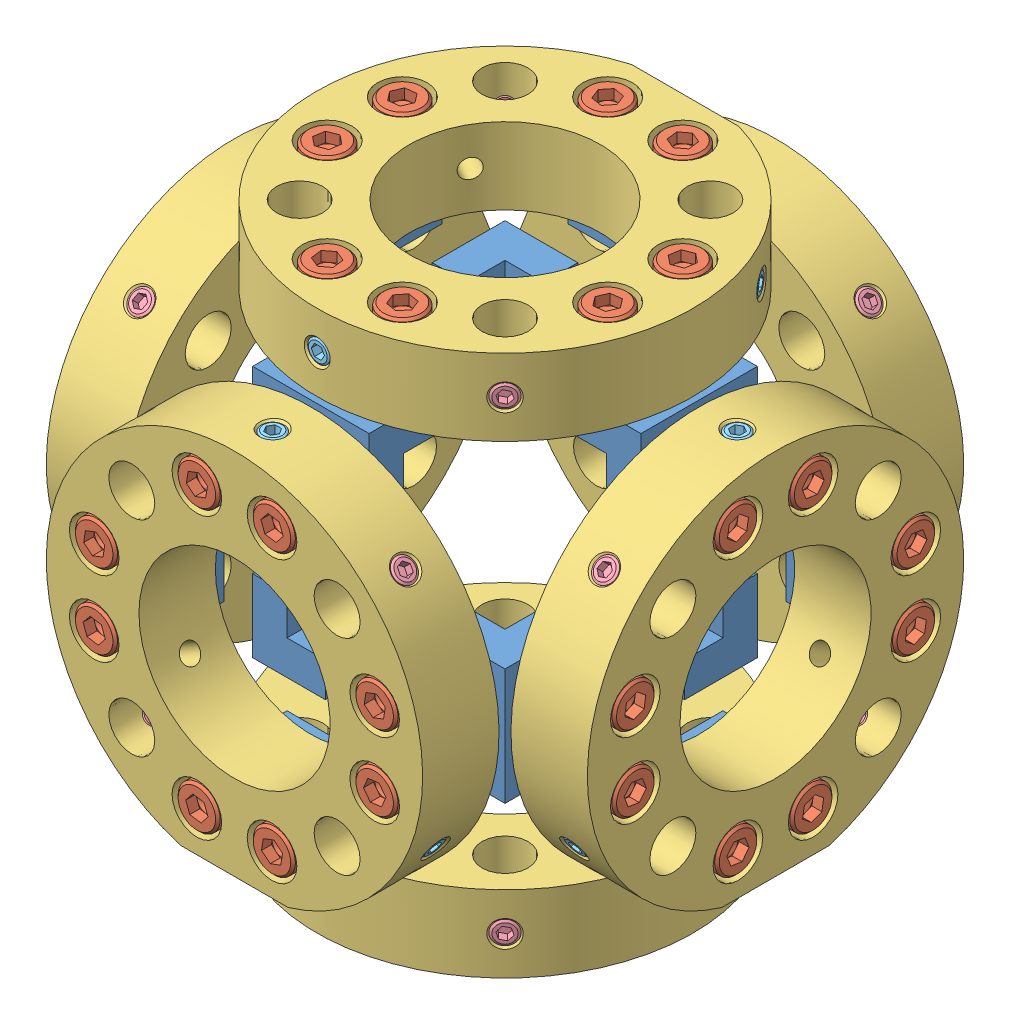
SolidWorks assembly design example 1 working.SLDASM, configuration Default (file format 4700). Lengths in mm.
Overall size (122.39 70.81 123.15).
126 component instances, 5 part files, 60 mates.
Components (placement in the parent):
- 85664-20: 85664.SLDASM [Default] at (26.6136 17.5576 15.4335) x (0 1 0) z (0 0 1) size (17.25 20.92 20.92)
  - 85664-1: 85664.SLDPRT [Default] at (-25.1776 1.211 9.9691) size (15.24 9.53 9.53)
  - M3x10 SHCS included-1: M3x10 SHCS included.SLDPRT [B18.3.1M - 3 x 0.5 x 10 Hex SHCS -- 10NHX] at (-22.4751 8.261 19.9691) x (0 0 -1) z (-0.99205 -0.125844 0) size (13 5.5 5.5)
  - M3x10 SHCS included-6: M3x10 SHCS included.SLDPRT [B18.3.1M - 3 x 0.5 x 10 Hex SHCS -- 10NHX] at (-12.6401 8.261 19.9691) x (0 0 -1) z (-0.778965 0.627068 0) size (13 5.5 5.5)
  - M3x10 SHCS included-5: M3x10 SHCS included.SLDPRT [B18.3.1M - 3 x 0.5 x 10 Hex SHCS -- 10NHX] at (-12.6401 -8.789 2.9191) x (0 1 0) z (-0.778965 0 0.627068) size (13 5.5 5.5)
  - M3x10 SHCS included-4: M3x10 SHCS included.SLDPRT [B18.3.1M - 3 x 0.5 x 10 Hex SHCS -- 10NHX] at (-22.4751 -8.789 2.9191) x (0 1 0) z (-0.35323 0 0.935536) size (13 5.5 5.5)
- 85664-21: 85664.SLDASM [Default] at (26.6136 -17.5576 -15.4335) x (0 -1 0) z (0 0 -1) size (17.25 20.92 20.92)
  - 85664-1: 85664.SLDPRT [Default] at (-25.1776 1.211 9.9691) size (15.24 9.53 9.53)
  - M3x10 SHCS included-1: M3x10 SHCS included.SLDPRT [B18.3.1M - 3 x 0.5 x 10 Hex SHCS -- 10NHX] at (-22.4751 8.261 19.9691) x (0 0 -1) z (-0.99205 -0.125844 0) size (13 5.5 5.5)
  - M3x10 SHCS included-6: M3x10 SHCS included.SLDPRT [B18.3.1M - 3 x 0.5 x 10 Hex SHCS -- 10NHX] at (-12.6401 8.261 19.9691) x (0 0 -1) z (-0.778965 0.627068 0) size (13 5.5 5.5)
  - M3x10 SHCS included-5: M3x10 SHCS included.SLDPRT [B18.3.1M - 3 x 0.5 x 10 Hex SHCS -- 10NHX] at (-12.6401 -8.789 2.9191) x (0 1 0) z (-0.778965 0 0.627068) size (13 5.5 5.5)
  - M3x10 SHCS included-4: M3x10 SHCS included.SLDPRT [B18.3.1M - 3 x 0.5 x 10 Hex SHCS -- 10NHX] at (-22.4751 -8.789 2.9191) x (0 1 0) z (-0.35323 0 0.935536) size (13 5.5 5.5)
- 85632-15: 85632.SLDASM [Default] at (-10.652 1.315 -49.5558) x (0 0 -1) z (1 0 0) size (10 48.22 49.25)
  - 85632 plate-1: 85632 plate.sldprt [Default] at (-24.1532 -1.3149 10.652) size (10 48.23 49.25)
  - M3x2.5 set screw included-1: M3x2.5 set screw included.SLDPRT [B18.3.6M - M3 x 0.5 x 2.5 Hex Socket Flat Pt. SS --N] at (-19.1532 16.045 28.012) x (0 -0.707107 -0.707107) z (0.73062 -0.482801 0.482801) size (2.5 3 3)
  - M3x2.5 set screw included-8: M3x2.5 set screw included.SLDPRT [B18.3.6M - M3 x 0.5 x 2.5 Hex Socket Flat Pt. SS --N] at (-19.1532 16.045 -6.7079) x (0 -0.707107 0.707107) z (0.73062 0.482801 0.482801) size (2.5 3 3)
  - M3x2.5 set screw included-9: M3x2.5 set screw included.SLDPRT [B18.3.6M - M3 x 0.5 x 2.5 Hex Socket Flat Pt. SS --N] at (-19.1532 -18.6749 -6.7079) x (0 0.707107 0.707107) z (0.73062 0.482801 -0.482801) size (2.5 3 3)
  - M3x2.5 set screw included-10: M3x2.5 set screw included.SLDPRT [B18.3.6M - M3 x 0.5 x 2.5 Hex Socket Flat Pt. SS --N] at (-19.1532 -18.6749 28.012) x (0 0.707107 -0.707107) z (0.73062 -0.482801 -0.482801) size (2.5 3 3)
  - M3x6 set screw included-11: M3x6 set screw included.SLDPRT [B18.3.6M - M3 x 0.5 x 6 Hex Socket Flat Pt. SS --N] at (-19.1532 23.1779 10.652) x (0 -1 0) z (0 0 1) size (6 3 3)
  - M3x6 set screw included-12: M3x6 set screw included.SLDPRT [B18.3.6M - M3 x 0.5 x 6 Hex Socket Flat Pt. SS --N] at (-19.1532 -13.5613 -10.5594) x (0 0.5 0.866025) z (0 0.866025 -0.5) size (6 3 3)
  - M3x6 set screw included-13: M3x6 set screw included.SLDPRT [B18.3.6M - M3 x 0.5 x 6 Hex Socket Flat Pt. SS --N] at (-19.1532 -13.5613 31.8634) x (0 0.5 -0.866025) z (0 -0.866025 -0.5) size (6 3 3)
- 85664-23: 85664.SLDASM [Default] at (-26.6136 17.5577 -15.4335) x (0 1 0) z (0 0 -1) size (17.25 20.92 20.92)
  - 85664-1: 85664.SLDPRT [Default] at (-25.1776 1.211 9.9691) size (15.24 9.53 9.53)
  - M3x10 SHCS included-1: M3x10 SHCS included.SLDPRT [B18.3.1M - 3 x 0.5 x 10 Hex SHCS -- 10NHX] at (-22.4751 8.261 19.9691) x (0 0 -1) z (-0.99205 -0.125844 0) size (13 5.5 5.5)
  - M3x10 SHCS included-6: M3x10 SHCS included.SLDPRT [B18.3.1M - 3 x 0.5 x 10 Hex SHCS -- 10NHX] at (-12.6401 8.261 19.9691) x (0 0 -1) z (-0.778965 0.627068 0) size (13 5.5 5.5)
  - M3x10 SHCS included-5: M3x10 SHCS included.SLDPRT [B18.3.1M - 3 x 0.5 x 10 Hex SHCS -- 10NHX] at (-12.6401 -8.789 2.9191) x (0 1 0) z (-0.778965 0 0.627068) size (13 5.5 5.5)
  - M3x10 SHCS included-4: M3x10 SHCS included.SLDPRT [B18.3.1M - 3 x 0.5 x 10 Hex SHCS -- 10NHX] at (-22.4751 -8.789 2.9191) x (0 1 0) z (-0.35323 0 0.935536) size (13 5.5 5.5)
- 85664-24: 85664.SLDASM [Default] at (-15.4335 17.5576 26.6136) x (0 1 0) z (-1 0 0) size (17.25 20.92 20.92)
  - 85664-1: 85664.SLDPRT [Default] at (-25.1776 1.211 9.9691) size (15.24 9.53 9.53)
  - M3x10 SHCS included-1: M3x10 SHCS included.SLDPRT [B18.3.1M - 3 x 0.5 x 10 Hex SHCS -- 10NHX] at (-22.4751 8.261 19.9691) x (0 0 -1) z (-0.99205 -0.125844 0) size (13 5.5 5.5)
  - M3x10 SHCS included-6: M3x10 SHCS included.SLDPRT [B18.3.1M - 3 x 0.5 x 10 Hex SHCS -- 10NHX] at (-12.6401 8.261 19.9691) x (0 0 -1) z (-0.778965 0.627068 0) size (13 5.5 5.5)
  - M3x10 SHCS included-5: M3x10 SHCS included.SLDPRT [B18.3.1M - 3 x 0.5 x 10 Hex SHCS -- 10NHX] at (-12.6401 -8.789 2.9191) x (0 1 0) z (-0.778965 0 0.627068) size (13 5.5 5.5)
  - M3x10 SHCS included-4: M3x10 SHCS included.SLDPRT [B18.3.1M - 3 x 0.5 x 10 Hex SHCS -- 10NHX] at (-22.4751 -8.789 2.9191) x (0 1 0) z (-0.35323 0 0.935536) size (13 5.5 5.5)
- 85632-14: 85632.SLDASM [Default] at (-49.5558 1.3149 10.652) x (-1 0 0) z (0 0 -1) size (10 48.22 49.25)
  - 85632 plate-1: 85632 plate.sldprt [Default] at (-24.1532 -1.3149 10.652) size (10 48.23 49.25)
  - M3x2.5 set screw included-1: M3x2.5 set screw included.SLDPRT [B18.3.6M - M3 x 0.5 x 2.5 Hex Socket Flat Pt. SS --N] at (-19.1532 16.045 28.012) x (0 -0.707107 -0.707107) z (0.73062 -0.482801 0.482801) size (2.5 3 3)
  - M3x2.5 set screw included-8: M3x2.5 set screw included.SLDPRT [B18.3.6M - M3 x 0.5 x 2.5 Hex Socket Flat Pt. SS --N] at (-19.1532 16.045 -6.7079) x (0 -0.707107 0.707107) z (0.73062 0.482801 0.482801) size (2.5 3 3)
  - M3x2.5 set screw included-9: M3x2.5 set screw included.SLDPRT [B18.3.6M - M3 x 0.5 x 2.5 Hex Socket Flat Pt. SS --N] at (-19.1532 -18.6749 -6.7079) x (0 0.707107 0.707107) z (0.73062 0.482801 -0.482801) size (2.5 3 3)
  - M3x2.5 set screw included-10: M3x2.5 set screw included.SLDPRT [B18.3.6M - M3 x 0.5 x 2.5 Hex Socket Flat Pt. SS --N] at (-19.1532 -18.6749 28.012) x (0 0.707107 -0.707107) z (0.73062 -0.482801 -0.482801) size (2.5 3 3)
  - M3x6 set screw included-11: M3x6 set screw included.SLDPRT [B18.3.6M - M3 x 0.5 x 6 Hex Socket Flat Pt. SS --N] at (-19.1532 23.1779 10.652) x (0 -1 0) z (0 0 1) size (6 3 3)
  - M3x6 set screw included-12: M3x6 set screw included.SLDPRT [B18.3.6M - M3 x 0.5 x 6 Hex Socket Flat Pt. SS --N] at (-19.1532 -13.5613 -10.5594) x (0 0.5 0.866025) z (0 0.866025 -0.5) size (6 3 3)
  - M3x6 set screw included-13: M3x6 set screw included.SLDPRT [B18.3.6M - M3 x 0.5 x 6 Hex Socket Flat Pt. SS --N] at (-19.1532 -13.5613 31.8634) x (0 0.5 -0.866025) z (0 -0.866025 -0.5) size (6 3 3)
- 85632-13: 85632.SLDASM [Default] at (10.652 1.3149 49.5558) x (0 0 1) z (-1 0 0) size (10 48.22 49.25)
  - 85632 plate-1: 85632 plate.sldprt [Default] at (-24.1532 -1.3149 10.652) size (10 48.23 49.25)
  - M3x2.5 set screw included-1: M3x2.5 set screw included.SLDPRT [B18.3.6M - M3 x 0.5 x 2.5 Hex Socket Flat Pt. SS --N] at (-19.1532 16.045 28.012) x (0 -0.707107 -0.707107) z (0.73062 -0.482801 0.482801) size (2.5 3 3)
  - M3x2.5 set screw included-8: M3x2.5 set screw included.SLDPRT [B18.3.6M - M3 x 0.5 x 2.5 Hex Socket Flat Pt. SS --N] at (-19.1532 16.045 -6.7079) x (0 -0.707107 0.707107) z (0.73062 0.482801 0.482801) size (2.5 3 3)
  - M3x2.5 set screw included-9: M3x2.5 set screw included.SLDPRT [B18.3.6M - M3 x 0.5 x 2.5 Hex Socket Flat Pt. SS --N] at (-19.1532 -18.6749 -6.7079) x (0 0.707107 0.707107) z (0.73062 0.482801 -0.482801) size (2.5 3 3)
  - M3x2.5 set screw included-10: M3x2.5 set screw included.SLDPRT [B18.3.6M - M3 x 0.5 x 2.5 Hex Socket Flat Pt. SS --N] at (-19.1532 -18.6749 28.012) x (0 0.707107 -0.707107) z (0.73062 -0.482801 -0.482801) size (2.5 3 3)
  - M3x6 set screw included-11: M3x6 set screw included.SLDPRT [B18.3.6M - M3 x 0.5 x 6 Hex Socket Flat Pt. SS --N] at (-19.1532 23.1779 10.652) x (0 -1 0) z (0 0 1) size (6 3 3)
  - M3x6 set screw included-12: M3x6 set screw included.SLDPRT [B18.3.6M - M3 x 0.5 x 6 Hex Socket Flat Pt. SS --N] at (-19.1532 -13.5613 -10.5594) x (0 0.5 0.866025) z (0 0.866025 -0.5) size (6 3 3)
  - M3x6 set screw included-13: M3x6 set screw included.SLDPRT [B18.3.6M - M3 x 0.5 x 6 Hex Socket Flat Pt. SS --N] at (-19.1532 -13.5613 31.8634) x (0 0.5 -0.866025) z (0 -0.866025 -0.5) size (6 3 3)
- 85632-12: 85632.SLDASM [Default] at (49.5558 1.3149 -10.652) size (10 48.22 49.25)
  - 85632 plate-1: 85632 plate.sldprt [Default] at (-24.1532 -1.3149 10.652) size (10 48.23 49.25)
  - M3x2.5 set screw included-1: M3x2.5 set screw included.SLDPRT [B18.3.6M - M3 x 0.5 x 2.5 Hex Socket Flat Pt. SS --N] at (-19.1532 16.045 28.012) x (0 -0.707107 -0.707107) z (0.73062 -0.482801 0.482801) size (2.5 3 3)
  - M3x2.5 set screw included-8: M3x2.5 set screw included.SLDPRT [B18.3.6M - M3 x 0.5 x 2.5 Hex Socket Flat Pt. SS --N] at (-19.1532 16.045 -6.7079) x (0 -0.707107 0.707107) z (0.73062 0.482801 0.482801) size (2.5 3 3)
  - M3x2.5 set screw included-9: M3x2.5 set screw included.SLDPRT [B18.3.6M - M3 x 0.5 x 2.5 Hex Socket Flat Pt. SS --N] at (-19.1532 -18.6749 -6.7079) x (0 0.707107 0.707107) z (0.73062 0.482801 -0.482801) size (2.5 3 3)
  - M3x2.5 set screw included-10: M3x2.5 set screw included.SLDPRT [B18.3.6M - M3 x 0.5 x 2.5 Hex Socket Flat Pt. SS --N] at (-19.1532 -18.6749 28.012) x (0 0.707107 -0.707107) z (0.73062 -0.482801 -0.482801) size (2.5 3 3)
  - M3x6 set screw included-11: M3x6 set screw included.SLDPRT [B18.3.6M - M3 x 0.5 x 6 Hex Socket Flat Pt. SS --N] at (-19.1532 23.1779 10.652) x (0 -1 0) z (0 0 1) size (6 3 3)
  - M3x6 set screw included-12: M3x6 set screw included.SLDPRT [B18.3.6M - M3 x 0.5 x 6 Hex Socket Flat Pt. SS --N] at (-19.1532 -13.5613 -10.5594) x (0 0.5 0.866025) z (0 0.866025 -0.5) size (6 3 3)
  - M3x6 set screw included-13: M3x6 set screw included.SLDPRT [B18.3.6M - M3 x 0.5 x 6 Hex Socket Flat Pt. SS --N] at (-19.1532 -13.5613 31.8634) x (0 0.5 -0.866025) z (0 -0.866025 -0.5) size (6 3 3)
- 85664-25: 85664.SLDASM [Default] at (-26.6136 15.4335 17.5577) x (0 0 1) z (0 1 0) size (17.25 20.92 20.92)
  - 85664-1: 85664.SLDPRT [Default] at (-25.1776 1.211 9.9691) size (15.24 9.53 9.53)
  - M3x10 SHCS included-1: M3x10 SHCS included.SLDPRT [B18.3.1M - 3 x 0.5 x 10 Hex SHCS -- 10NHX] at (-22.4751 8.261 19.9691) x (0 0 -1) z (-0.99205 -0.125844 0) size (13 5.5 5.5)
  - M3x10 SHCS included-6: M3x10 SHCS included.SLDPRT [B18.3.1M - 3 x 0.5 x 10 Hex SHCS -- 10NHX] at (-12.6401 8.261 19.9691) x (0 0 -1) z (-0.778965 0.627068 0) size (13 5.5 5.5)
  - M3x10 SHCS included-5: M3x10 SHCS included.SLDPRT [B18.3.1M - 3 x 0.5 x 10 Hex SHCS -- 10NHX] at (-12.6401 -8.789 2.9191) x (0 1 0) z (-0.778965 0 0.627068) size (13 5.5 5.5)
  - M3x10 SHCS included-4: M3x10 SHCS included.SLDPRT [B18.3.1M - 3 x 0.5 x 10 Hex SHCS -- 10NHX] at (-22.4751 -8.789 2.9191) x (0 1 0) z (-0.35323 0 0.935536) size (13 5.5 5.5)
- 85664-26: 85664.SLDASM [Default] at (-17.5576 15.4336 -26.6136) x (-1 0 0) z (0 1 0) size (17.25 20.92 20.92)
  - 85664-1: 85664.SLDPRT [Default] at (-25.1776 1.211 9.9691) size (15.24 9.53 9.53)
  - M3x10 SHCS included-1: M3x10 SHCS included.SLDPRT [B18.3.1M - 3 x 0.5 x 10 Hex SHCS -- 10NHX] at (-22.4751 8.261 19.9691) x (0 0 -1) z (-0.99205 -0.125844 0) size (13 5.5 5.5)
  - M3x10 SHCS included-6: M3x10 SHCS included.SLDPRT [B18.3.1M - 3 x 0.5 x 10 Hex SHCS -- 10NHX] at (-12.6401 8.261 19.9691) x (0 0 -1) z (-0.778965 0.627068 0) size (13 5.5 5.5)
  - M3x10 SHCS included-5: M3x10 SHCS included.SLDPRT [B18.3.1M - 3 x 0.5 x 10 Hex SHCS -- 10NHX] at (-12.6401 -8.789 2.9191) x (0 1 0) z (-0.778965 0 0.627068) size (13 5.5 5.5)
  - M3x10 SHCS included-4: M3x10 SHCS included.SLDPRT [B18.3.1M - 3 x 0.5 x 10 Hex SHCS -- 10NHX] at (-22.4751 -8.789 2.9191) x (0 1 0) z (-0.35323 0 0.935536) size (13 5.5 5.5)
- 85664-27: 85664.SLDASM [Default] at (26.6136 15.4335 -17.5577) x (0 0 -1) z (0 1 0) size (17.25 20.92 20.92)
  - 85664-1: 85664.SLDPRT [Default] at (-25.1776 1.211 9.9691) size (15.24 9.53 9.53)
  - M3x10 SHCS included-1: M3x10 SHCS included.SLDPRT [B18.3.1M - 3 x 0.5 x 10 Hex SHCS -- 10NHX] at (-22.4751 8.261 19.9691) x (0 0 -1) z (-0.99205 -0.125844 0) size (13 5.5 5.5)
  - M3x10 SHCS included-6: M3x10 SHCS included.SLDPRT [B18.3.1M - 3 x 0.5 x 10 Hex SHCS -- 10NHX] at (-12.6401 8.261 19.9691) x (0 0 -1) z (-0.778965 0.627068 0) size (13 5.5 5.5)
  - M3x10 SHCS included-5: M3x10 SHCS included.SLDPRT [B18.3.1M - 3 x 0.5 x 10 Hex SHCS -- 10NHX] at (-12.6401 -8.789 2.9191) x (0 1 0) z (-0.778965 0 0.627068) size (13 5.5 5.5)
  - M3x10 SHCS included-4: M3x10 SHCS included.SLDPRT [B18.3.1M - 3 x 0.5 x 10 Hex SHCS -- 10NHX] at (-22.4751 -8.789 2.9191) x (0 1 0) z (-0.35323 0 0.935536) size (13 5.5 5.5)
- 85664-28: 85664.SLDASM [Default] at (17.5576 15.4335 26.6136) x (1 0 0) z (0 1 0) size (17.25 20.92 20.92)
  - 85664-1: 85664.SLDPRT [Default] at (-25.1776 1.211 9.9691) size (15.24 9.53 9.53)
  - M3x10 SHCS included-1: M3x10 SHCS included.SLDPRT [B18.3.1M - 3 x 0.5 x 10 Hex SHCS -- 10NHX] at (-22.4751 8.261 19.9691) x (0 0 -1) z (-0.99205 -0.125844 0) size (13 5.5 5.5)
  - M3x10 SHCS included-6: M3x10 SHCS included.SLDPRT [B18.3.1M - 3 x 0.5 x 10 Hex SHCS -- 10NHX] at (-12.6401 8.261 19.9691) x (0 0 -1) z (-0.778965 0.627068 0) size (13 5.5 5.5)
  - M3x10 SHCS included-5: M3x10 SHCS included.SLDPRT [B18.3.1M - 3 x 0.5 x 10 Hex SHCS -- 10NHX] at (-12.6401 -8.789 2.9191) x (0 1 0) z (-0.778965 0 0.627068) size (13 5.5 5.5)
  - M3x10 SHCS included-4: M3x10 SHCS included.SLDPRT [B18.3.1M - 3 x 0.5 x 10 Hex SHCS -- 10NHX] at (-22.4751 -8.789 2.9191) x (0 1 0) z (-0.35323 0 0.935536) size (13 5.5 5.5)
- 85664-29: 85664.SLDASM [Default] at (17.5576 -15.4334 -26.6136) x (1 0 0) z (0 -1 0) size (17.25 20.92 20.92)
  - 85664-1: 85664.SLDPRT [Default] at (-25.1776 1.211 9.9691) size (15.24 9.53 9.53)
  - M3x10 SHCS included-1: M3x10 SHCS included.SLDPRT [B18.3.1M - 3 x 0.5 x 10 Hex SHCS -- 10NHX] at (-22.4751 8.261 19.9691) x (0 0 -1) z (-0.99205 -0.125844 0) size (13 5.5 5.5)
  - M3x10 SHCS included-6: M3x10 SHCS included.SLDPRT [B18.3.1M - 3 x 0.5 x 10 Hex SHCS -- 10NHX] at (-12.6401 8.261 19.9691) x (0 0 -1) z (-0.778965 0.627068 0) size (13 5.5 5.5)
  - M3x10 SHCS included-5: M3x10 SHCS included.SLDPRT [B18.3.1M - 3 x 0.5 x 10 Hex SHCS -- 10NHX] at (-12.6401 -8.789 2.9191) x (0 1 0) z (-0.778965 0 0.627068) size (13 5.5 5.5)
  - M3x10 SHCS included-4: M3x10 SHCS included.SLDPRT [B18.3.1M - 3 x 0.5 x 10 Hex SHCS -- 10NHX] at (-22.4751 -8.789 2.9191) x (0 1 0) z (-0.35323 0 0.935536) size (13 5.5 5.5)
- 85664-30: 85664.SLDASM [Default] at (26.6136 -15.4335 17.5576) x (0 0 1) z (0 -1 0) size (17.25 20.92 20.92)
  - 85664-1: 85664.SLDPRT [Default] at (-25.1776 1.211 9.9691) size (15.24 9.53 9.53)
  - M3x10 SHCS included-1: M3x10 SHCS included.SLDPRT [B18.3.1M - 3 x 0.5 x 10 Hex SHCS -- 10NHX] at (-22.4751 8.261 19.9691) x (0 0 -1) z (-0.99205 -0.125844 0) size (13 5.5 5.5)
  - M3x10 SHCS included-6: M3x10 SHCS included.SLDPRT [B18.3.1M - 3 x 0.5 x 10 Hex SHCS -- 10NHX] at (-12.6401 8.261 19.9691) x (0 0 -1) z (-0.778965 0.627068 0) size (13 5.5 5.5)
  - M3x10 SHCS included-5: M3x10 SHCS included.SLDPRT [B18.3.1M - 3 x 0.5 x 10 Hex SHCS -- 10NHX] at (-12.6401 -8.789 2.9191) x (0 1 0) z (-0.778965 0 0.627068) size (13 5.5 5.5)
  - M3x10 SHCS included-4: M3x10 SHCS included.SLDPRT [B18.3.1M - 3 x 0.5 x 10 Hex SHCS -- 10NHX] at (-22.4751 -8.789 2.9191) x (0 1 0) z (-0.35323 0 0.935536) size (13 5.5 5.5)
- 85664-31: 85664.SLDASM [Default] at (-17.5577 -15.4335 26.6136) x (-1 0 0) z (0 -1 0) size (17.25 20.92 20.92)
  - 85664-1: 85664.SLDPRT [Default] at (-25.1776 1.211 9.9691) size (15.24 9.53 9.53)
  - M3x10 SHCS included-1: M3x10 SHCS included.SLDPRT [B18.3.1M - 3 x 0.5 x 10 Hex SHCS -- 10NHX] at (-22.4751 8.261 19.9691) x (0 0 -1) z (-0.99205 -0.125844 0) size (13 5.5 5.5)
  - M3x10 SHCS included-6: M3x10 SHCS included.SLDPRT [B18.3.1M - 3 x 0.5 x 10 Hex SHCS -- 10NHX] at (-12.6401 8.261 19.9691) x (0 0 -1) z (-0.778965 0.627068 0) size (13 5.5 5.5)
  - M3x10 SHCS included-5: M3x10 SHCS included.SLDPRT [B18.3.1M - 3 x 0.5 x 10 Hex SHCS -- 10NHX] at (-12.6401 -8.789 2.9191) x (0 1 0) z (-0.778965 0 0.627068) size (13 5.5 5.5)
  - M3x10 SHCS included-4: M3x10 SHCS included.SLDPRT [B18.3.1M - 3 x 0.5 x 10 Hex SHCS -- 10NHX] at (-22.4751 -8.789 2.9191) x (0 1 0) z (-0.35323 0 0.935536) size (13 5.5 5.5)
- 85664-32: 85664.SLDASM [Default] at (-26.6136 -15.4335 -17.5576) x (0 0 -1) z (0 -1 0) size (17.25 20.92 20.92)
  - 85664-1: 85664.SLDPRT [Default] at (-25.1776 1.211 9.9691) size (15.24 9.53 9.53)
  - M3x10 SHCS included-1: M3x10 SHCS included.SLDPRT [B18.3.1M - 3 x 0.5 x 10 Hex SHCS -- 10NHX] at (-22.4751 8.261 19.9691) x (0 0 -1) z (-0.99205 -0.125844 0) size (13 5.5 5.5)
  - M3x10 SHCS included-6: M3x10 SHCS included.SLDPRT [B18.3.1M - 3 x 0.5 x 10 Hex SHCS -- 10NHX] at (-12.6401 8.261 19.9691) x (0 0 -1) z (-0.778965 0.627068 0) size (13 5.5 5.5)
  - M3x10 SHCS included-5: M3x10 SHCS included.SLDPRT [B18.3.1M - 3 x 0.5 x 10 Hex SHCS -- 10NHX] at (-12.6401 -8.789 2.9191) x (0 1 0) z (-0.778965 0 0.627068) size (13 5.5 5.5)
  - M3x10 SHCS included-4: M3x10 SHCS included.SLDPRT [B18.3.1M - 3 x 0.5 x 10 Hex SHCS -- 10NHX] at (-22.4751 -8.789 2.9191) x (0 1 0) z (-0.35323 0 0.935536) size (13 5.5 5.5)
- 85632-17: 85632.SLDASM [Default] at (-10.652 49.5558 1.3149) x (0 1 0) z (1 0 0) size (10 48.22 49.25)
  - 85632 plate-1: 85632 plate.sldprt [Default] at (-24.1532 -1.3149 10.652) size (10 48.23 49.25)
  - M3x2.5 set screw included-1: M3x2.5 set screw included.SLDPRT [B18.3.6M - M3 x 0.5 x 2.5 Hex Socket Flat Pt. SS --N] at (-19.1532 16.045 28.012) x (0 -0.707107 -0.707107) z (0.73062 -0.482801 0.482801) size (2.5 3 3)
  - M3x2.5 set screw included-8: M3x2.5 set screw included.SLDPRT [B18.3.6M - M3 x 0.5 x 2.5 Hex Socket Flat Pt. SS --N] at (-19.1532 16.045 -6.7079) x (0 -0.707107 0.707107) z (0.73062 0.482801 0.482801) size (2.5 3 3)
  - M3x2.5 set screw included-9: M3x2.5 set screw included.SLDPRT [B18.3.6M - M3 x 0.5 x 2.5 Hex Socket Flat Pt. SS --N] at (-19.1532 -18.6749 -6.7079) x (0 0.707107 0.707107) z (0.73062 0.482801 -0.482801) size (2.5 3 3)
  - M3x2.5 set screw included-10: M3x2.5 set screw included.SLDPRT [B18.3.6M - M3 x 0.5 x 2.5 Hex Socket Flat Pt. SS --N] at (-19.1532 -18.6749 28.012) x (0 0.707107 -0.707107) z (0.73062 -0.482801 -0.482801) size (2.5 3 3)
  - M3x6 set screw included-11: M3x6 set screw included.SLDPRT [B18.3.6M - M3 x 0.5 x 6 Hex Socket Flat Pt. SS --N] at (-19.1532 23.1779 10.652) x (0 -1 0) z (0 0 1) size (6 3 3)
  - M3x6 set screw included-12: M3x6 set screw included.SLDPRT [B18.3.6M - M3 x 0.5 x 6 Hex Socket Flat Pt. SS --N] at (-19.1532 -13.5613 -10.5594) x (0 0.5 0.866025) z (0 0.866025 -0.5) size (6 3 3)
  - M3x6 set screw included-13: M3x6 set screw included.SLDPRT [B18.3.6M - M3 x 0.5 x 6 Hex Socket Flat Pt. SS --N] at (-19.1532 -13.5613 31.8634) x (0 0.5 -0.866025) z (0 -0.866025 -0.5) size (6 3 3)
- 85632-16: 85632.SLDASM [Default] at (10.652 -49.5558 1.3149) x (0 -1 0) z (-1 0 0) size (10 48.22 49.25)
  - 85632 plate-1: 85632 plate.sldprt [Default] at (-24.1532 -1.3149 10.652) size (10 48.23 49.25)
  - M3x2.5 set screw included-1: M3x2.5 set screw included.SLDPRT [B18.3.6M - M3 x 0.5 x 2.5 Hex Socket Flat Pt. SS --N] at (-19.1532 16.045 28.012) x (0 -0.707107 -0.707107) z (0.73062 -0.482801 0.482801) size (2.5 3 3)
  - M3x2.5 set screw included-8: M3x2.5 set screw included.SLDPRT [B18.3.6M - M3 x 0.5 x 2.5 Hex Socket Flat Pt. SS --N] at (-19.1532 16.045 -6.7079) x (0 -0.707107 0.707107) z (0.73062 0.482801 0.482801) size (2.5 3 3)
  - M3x2.5 set screw included-9: M3x2.5 set screw included.SLDPRT [B18.3.6M - M3 x 0.5 x 2.5 Hex Socket Flat Pt. SS --N] at (-19.1532 -18.6749 -6.7079) x (0 0.707107 0.707107) z (0.73062 0.482801 -0.482801) size (2.5 3 3)
  - M3x2.5 set screw included-10: M3x2.5 set screw included.SLDPRT [B18.3.6M - M3 x 0.5 x 2.5 Hex Socket Flat Pt. SS --N] at (-19.1532 -18.6749 28.012) x (0 0.707107 -0.707107) z (0.73062 -0.482801 -0.482801) size (2.5 3 3)
  - M3x6 set screw included-11: M3x6 set screw included.SLDPRT [B18.3.6M - M3 x 0.5 x 6 Hex Socket Flat Pt. SS --N] at (-19.1532 23.1779 10.652) x (0 -1 0) z (0 0 1) size (6 3 3)
  - M3x6 set screw included-12: M3x6 set screw included.SLDPRT [B18.3.6M - M3 x 0.5 x 6 Hex Socket Flat Pt. SS --N] at (-19.1532 -13.5613 -10.5594) x (0 0.5 0.866025) z (0 0.866025 -0.5) size (6 3 3)
  - M3x6 set screw included-13: M3x6 set screw included.SLDPRT [B18.3.6M - M3 x 0.5 x 6 Hex Socket Flat Pt. SS --N] at (-19.1532 -13.5613 31.8634) x (0 0.5 -0.866025) z (0 -0.866025 -0.5) size (6 3 3)
Mates (geometry in assembly coordinates):
- Concentric27: concentric anti-aligned: cone of 85664-21/85664-1 through (18.3526 4.9176 -25.1026) axis (0 0 1); cylinder of 85632-15/85632 plate-1 through (18.3526 4.9177 -35.4026) axis (0 0 -1) radius 1.6
- Coincident21: coincident anti-aligned: plane of 85664-21/85664-1 through (20.6401 -7.6199 -25.4026) normal (0 0 -1); plane of 85632-15/85632 plate-1 through (0 0.0001 -25.4026) normal (0 0 1)
- Concentric32: concentric anti-aligned: cylinder of 85632-15/85632 plate-1 through (-18.3526 4.9177 -35.4026) axis (0 0 -1) radius 1.6; cone of 85664-23/85664-1 through (-18.3526 4.9176 -25.1026) axis (0 0 1)
- Coincident23: coincident anti-aligned: plane of 85632-15/85632 plate-1 through (0 0.0001 -25.4026) normal (0 0 1); plane of 85664-23/85664-1 through (-20.6401 7.6201 -25.4026) normal (0 0 -1)
- Concentric37: concentric anti-aligned: cone of 85664-24/85664-1 through (-25.1026 4.9174 18.3526) axis (1 0 0); cylinder of 85632-14/85632 plate-1 through (-35.4026 4.9176 18.3526) axis (-1 0 0) radius 1.6
- Coincident25: coincident anti-aligned: plane of 85664-24/85664-1 through (-25.4026 7.6199 20.6401) normal (-1 0 0); plane of 85632-14/85632 plate-1 through (-25.4026 0 0) normal (1 0 0)
- Concentric43: concentric anti-aligned: cone of 85664-24/85664-1 through (-18.3526 4.9174 25.1026) axis (0 0 -1); cylinder of 85632-13/85632 plate-1 through (-18.3526 4.9176 35.4026) axis (0 0 1) radius 1.6
- Coincident29: coincident anti-aligned: plane of 85664-24/85664-1 through (-10.0212 7.6199 25.4026) normal (0 0 1); plane of 85632-13/85632 plate-1 through (0 0 25.4026) normal (0 0 -1)
- Concentric49: concentric anti-aligned: cone of 85664-21/85664-1 through (25.1026 -4.9174 -18.3526) axis (-1 0 0); cylinder of 85632-12/85632 plate-1 through (35.4026 -4.9176 -18.3526) axis (1 0 0) radius 1.6
- Coincident35: coincident anti-aligned: plane of 85664-21/85664-1 through (25.4026 -7.6199 -10.0212) normal (1 0 0); plane of 85632-12/85632 plate-1 through (25.4026 0 0) normal (-1 0 0)
- Concentric52: concentric anti-aligned: cylinder of 85632-14/85632 plate-1 through (-35.4026 18.3526 -4.9176) axis (-1 0 0) radius 1.6; cone of 85664-25/85664-1 through (-25.1026 18.3526 -4.9174) axis (1 0 0)
- Coincident37: coincident anti-aligned: plane of 85632-14/85632 plate-1 through (-25.4026 0 0) normal (1 0 0); plane of 85664-25/85664-1 through (-25.4026 10.0212 7.6201) normal (-1 0 0)
- Concentric54: concentric anti-aligned: cylinder of 85632-15/85632 plate-1 through (-4.9176 18.3527 -35.4026) axis (0 0 -1) radius 1.6; cone of 85664-26/85664-1 through (-4.9174 18.3527 -25.1026) axis (0 0 1)
- Coincident38: coincident anti-aligned: plane of 85632-15/85632 plate-1 through (0 0.0001 -25.4026) normal (0 0 1); plane of 85664-26/85664-1 through (-7.6199 10.0213 -25.4026) normal (0 0 -1)
- Concentric56: concentric anti-aligned: cylinder of 85632-12/85632 plate-1 through (35.4026 18.3526 4.9176) axis (1 0 0) radius 1.6; cone of 85664-27/85664-1 through (25.1026 18.3526 4.9174) axis (-1 0 0)
- Coincident39: coincident anti-aligned: plane of 85632-12/85632 plate-1 through (25.4026 0 0) normal (-1 0 0); plane of 85664-27/85664-1 through (25.4026 10.0212 -7.6201) normal (1 0 0)
- Concentric58: concentric anti-aligned: cylinder of 85632-13/85632 plate-1 through (4.9176 18.3526 35.4026) axis (0 0 1) radius 1.6; cone of 85664-28/85664-1 through (4.9174 18.3526 25.1026) axis (0 0 -1)
- Coincident40: coincident anti-aligned: plane of 85632-13/85632 plate-1 through (0 0 25.4026) normal (0 0 -1); plane of 85664-28/85664-1 through (7.6199 10.0212 25.4026) normal (0 0 1)
- Concentric61: concentric anti-aligned: cylinder of 85632-15/85632 plate-1 through (4.9176 -18.3525 -35.4026) axis (0 0 -1) radius 1.6; cone of 85664-29/85664-1 through (4.9174 -18.3525 -25.1026) axis (0 0 1)
- Coincident42: coincident anti-aligned: plane of 85632-15/85632 plate-1 through (0 0.0001 -25.4026) normal (0 0 1); plane of 85664-29/85664-1 through (7.6199 -10.021 -25.4026) normal (0 0 -1)
- Concentric63: concentric anti-aligned: cylinder of 85632-13/85632 plate-1 through (4.9176 -18.3526 35.4026) axis (0 0 1) radius 1.6; cone of 85664-31/85664-1 through (4.9174 -18.3526 25.1026) axis (0 0 -1)
- Coincident43: coincident anti-aligned: plane of 85632-13/85632 plate-1 through (0 0 25.4026) normal (0 0 -1); plane of 85664-31/85664-1 through (-7.6201 -10.0212 25.4026) normal (0 0 1)
- Concentric65: concentric anti-aligned: cylinder of 85632-12/85632 plate-1 through (35.4026 -18.3526 4.9176) axis (1 0 0) radius 1.6; cone of 85664-30/85664-1 through (25.1026 -18.3526 4.9174) axis (-1 0 0)
- Coincident44: coincident anti-aligned: plane of 85632-12/85632 plate-1 through (25.4026 0 0) normal (-1 0 0); plane of 85664-30/85664-1 through (25.4026 -10.0212 7.6199) normal (1 0 0)
- Concentric67: concentric anti-aligned: cylinder of 85632-14/85632 plate-1 through (-35.4026 -18.3526 -4.9176) axis (-1 0 0) radius 1.6; cone of 85664-32/85664-1 through (-25.1026 -18.3526 -4.9174) axis (1 0 0)
- Coincident45: coincident anti-aligned: plane of 85632-14/85632 plate-1 through (-25.4026 0 0) normal (1 0 0); plane of 85664-32/85664-1 through (-25.4026 -10.0212 -7.6199) normal (-1 0 0)
- Coincident46: coincident anti-aligned: plane of 85664-26/85664-1 through (-7.6199 25.4027 -20.6401) normal (0 1 0); plane of 85632-17/85632 plate-1 through (0 25.4026 0) normal (0 -1 0)
- Coincident47: coincident anti-aligned: plane of 85664-32/85664-1 through (-20.6401 -25.4026 -7.6199) normal (0 -1 0); plane of 85632-16/85632 plate-1 through (0 -25.4026 0) normal (0 1 0)
- Concentric78: concentric aligned: cylinder of 85632-12/85632 plate-1 through (35.4026 0 0) axis (-1 0 0) radius 24.625
- Concentric79: concentric anti-aligned: cylinder of 85632-13/85632 plate-1 through (0 0 35.4026) axis (0 0 -1) radius 24.625
- Concentric81: concentric aligned: cylinder of 85632-12/85632 plate-1 through (35.4026 18.3526 -4.9176) axis (1 0 0) radius 1.6; cylinder of 85664-27/85664-1 through (25.4026 18.3526 -4.9176) axis (1 0 0) radius 1.25
- Concentric82: concentric aligned: cylinder of 85632-12/85632 plate-1 through (35.4026 -18.3526 -4.9176) axis (1 0 0) radius 1.6; cylinder of 85664-30/85664-1 through (25.4026 -18.3526 -4.9176) axis (1 0 0) radius 1.25
- Concentric83: concentric aligned: cylinder of 85632-15/85632 plate-1 through (-4.9176 -18.3525 -35.4026) axis (0 0 -1) radius 1.6; cylinder of 85664-29/85664-1 through (-4.9176 -18.3525 -25.4026) axis (0 0 -1) radius 1.25
- Concentric84: concentric aligned: cylinder of 85632-15/85632 plate-1 through (-18.3526 -4.9174 -35.4026) axis (0 0 -1) radius 1.6; cylinder of 85664-23/85664-1 through (-18.3526 -4.9174 -25.4026) axis (0 0 -1) radius 1.25
- Concentric85: concentric aligned: cylinder of 85632-15/85632 plate-1 through (4.9176 18.3527 -35.4026) axis (0 0 -1) radius 1.6; cylinder of 85664-26/85664-1 through (4.9176 18.3527 -25.4026) axis (0 0 -1) radius 1.25
- Concentric86: concentric aligned: cylinder of 85664-21/85664-1 through (18.3526 -4.9174 -25.4026) axis (0 0 -1) radius 1.25; cylinder of 85632-15/85632 plate-1 through (18.3526 -4.9174 -35.4026) axis (0 0 -1) radius 1.6
- Concentric87: concentric aligned: cylinder of 85664-21/85664-1 through (25.4026 4.9176 -18.3526) axis (1 0 0) radius 1.25; cylinder of 85632-12/85632 plate-1 through (35.4026 4.9176 -18.3526) axis (1 0 0) radius 1.6
- Concentric88: concentric aligned: cylinder of 85632-13/85632 plate-1 through (-4.9176 18.3526 35.4026) axis (0 0 1) radius 1.6; cylinder of 85664-28/85664-1 through (-4.9176 18.3526 25.4026) axis (0 0 1) radius 1.25
- Concentric89: concentric aligned: cylinder of 85664-24/85664-1 through (-18.3526 -4.9176 25.4026) axis (0 0 1) radius 1.25; cylinder of 85632-13/85632 plate-1 through (-18.3526 -4.9176 35.4026) axis (0 0 1) radius 1.6
- Concentric90: concentric aligned: cylinder of 85664-24/85664-1 through (-25.4026 -4.9176 18.3526) axis (-1 0 0) radius 1.25; cylinder of 85632-14/85632 plate-1 through (-35.4026 -4.9176 18.3526) axis (-1 0 0) radius 1.6
- Concentric91: concentric aligned: cylinder of 85632-13/85632 plate-1 through (-4.9176 -18.3526 35.4026) axis (0 0 1) radius 1.6; cylinder of 85664-31/85664-1 through (-4.9176 -18.3526 25.4026) axis (0 0 1) radius 1.25
- Concentric93: concentric aligned: cylinder of 85632-14/85632 plate-1 through (-35.4026 -18.3526 4.9176) axis (-1 0 0) radius 1.6; cylinder of 85664-32/85664-1 through (-25.4026 -18.3526 4.9176) axis (-1 0 0) radius 1.25
- Coincident51: coincident anti-aligned: plane of 85664-20/85664-1 through (20.6401 7.6199 25.4026) normal (0 0 1); plane of 85632-13/85632 plate-1 through (0 0 25.4026) normal (0 0 -1)
- Concentric96: concentric aligned: cylinder of 85664-20/85664-1 through (18.3526 4.9174 25.4026) axis (0 0 1) radius 1.25; cylinder of 85632-13/85632 plate-1 through (18.3526 4.9176 35.4026) axis (0 0 1) radius 1.6
- Concentric97: concentric aligned: cylinder of 85664-20/85664-1 through (18.3526 -4.9176 25.4026) axis (0 0 1) radius 1.25; cylinder of 85632-13/85632 plate-1 through (18.3526 -4.9176 35.4026) axis (0 0 1) radius 1.6
- Concentric98: concentric aligned: cylinder of 85664-31/85664-1 through (-4.9176 -25.4026 18.3526) axis (0 -1 0) radius 1.25; cylinder of 85632-16/85632 plate-1 through (-4.9176 -35.4026 18.3526) axis (0 -1 0) radius 1.6
- Concentric99: concentric aligned: cylinder of 85664-31/85664-1 through (4.9174 -25.4026 18.3526) axis (0 -1 0) radius 1.25; cylinder of 85632-16/85632 plate-1 through (4.9176 -35.4026 18.3526) axis (0 -1 0) radius 1.6
- Concentric100: concentric aligned: cylinder of 85664-32/85664-1 through (-18.3526 -25.4026 4.9176) axis (0 -1 0) radius 1.25; cylinder of 85632-16/85632 plate-1 through (-18.3526 -35.4026 4.9176) axis (0 -1 0) radius 1.6
- Concentric101: concentric aligned: cylinder of 85664-32/85664-1 through (-18.3526 -25.4026 -4.9174) axis (0 -1 0) radius 1.25; cylinder of 85632-16/85632 plate-1 through (-18.3526 -35.4026 -4.9176) axis (0 -1 0) radius 1.6
- Concentric104: concentric anti-aligned: cone of 85664-28/85664-1 through (4.9174 25.1026 18.3526) axis (0 -1 0); cylinder of 85632-17/85632 plate-1 through (4.9176 35.4026 18.3526) axis (0 1 0) radius 1.6
- Coincident53: coincident anti-aligned: plane of 85664-28/85664-1 through (7.6199 25.4026 20.6401) normal (0 1 0); plane of 85632-17/85632 plate-1 through (0 25.4026 0) normal (0 -1 0)
- Concentric107: concentric aligned: cylinder of 85664-28/85664-1 through (-4.9176 25.4026 18.3526) axis (0 1 0) radius 1.25; cylinder of 85632-17/85632 plate-1 through (-4.9176 35.4026 18.3526) axis (0 1 0) radius 1.6
- Concentric108: concentric aligned: cylinder of 85664-25/85664-1 through (-18.3526 25.4026 4.9176) axis (0 1 0) radius 1.25; cylinder of 85632-17/85632 plate-1 through (-18.3526 35.4026 4.9176) axis (0 1 0) radius 1.6
- Concentric109: concentric aligned: cylinder of 85664-25/85664-1 through (-18.3526 25.4026 -4.9174) axis (0 1 0) radius 1.25; cylinder of 85632-17/85632 plate-1 through (-18.3526 35.4026 -4.9176) axis (0 1 0) radius 1.6
- Coincident54: coincident anti-aligned: plane of 85664-27/85664-1 through (20.6401 25.4026 -7.6201) normal (0 1 0); plane of 85632-17/85632 plate-1 through (0 25.4026 0) normal (0 -1 0)
- Coincident55: coincident anti-aligned: plane of 85664-26/85664-1 through (-7.6199 25.4027 -20.6401) normal (0 1 0); plane of 85632-17/85632 plate-1 through (0 25.4026 0) normal (0 -1 0)
- Coincident56: coincident anti-aligned: plane of 85664-30/85664-1 through (20.6401 -25.4026 7.6199) normal (0 -1 0); plane of 85632-16/85632 plate-1 through (0 -25.4026 0) normal (0 1 0)
- Coincident57: coincident anti-aligned: plane of 85664-29/85664-1 through (7.6199 -25.4025 -20.6401) normal (0 -1 0); plane of 85632-16/85632 plate-1 through (0 -25.4026 0) normal (0 1 0)
- Coincident58: coincident anti-aligned: plane of 85664-23/85664-1 through (-25.4026 7.6201 -10.0212) normal (-1 0 0); plane of 85632-14/85632 plate-1 through (-25.4026 0 0) normal (1 0 0)
- Concentric110: concentric aligned: cylinder of 85664-23/85664-1 through (-25.4026 4.9176 -18.3526) axis (-1 0 0) radius 1.25; cylinder of 85632-14/85632 plate-1 through (-35.4026 4.9176 -18.3526) axis (-1 0 0) radius 1.6
